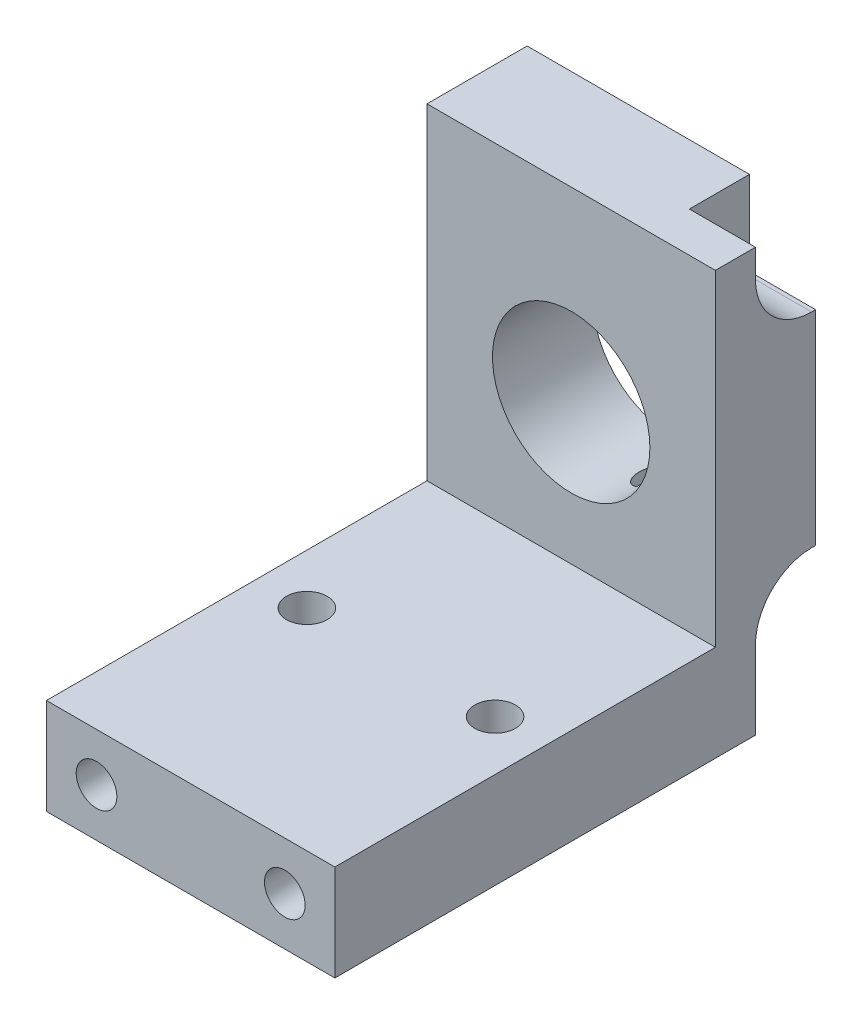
ISO-10303-21;
HEADER;
FILE_DESCRIPTION(('STEP AP214'),'2;1');
FILE_NAME('part.step','',(''),(''),'','','');
FILE_SCHEMA(('AUTOMOTIVE_DESIGN { 1 0 10303 214 1 1 1 1 }'));
ENDSEC;
DATA;
#1=APPLICATION_CONTEXT('core data for automotive mechanical design processes');
#2=APPLICATION_PROTOCOL_DEFINITION('international standard','automotive_design',2000,#1);
#3=PRODUCT_CONTEXT('',#1,'mechanical');
#4=PRODUCT('Part','Part','',(#3));
#5=PRODUCT_RELATED_PRODUCT_CATEGORY('part','',(#4));
#6=PRODUCT_DEFINITION_FORMATION('','',#4);
#7=PRODUCT_DEFINITION_CONTEXT('part definition',#1,'design');
#8=PRODUCT_DEFINITION('design','',#6,#7);
#9=PRODUCT_DEFINITION_SHAPE('','',#8);
#10=(LENGTH_UNIT() NAMED_UNIT(*) SI_UNIT(.MILLI.,.METRE.));
#11=(NAMED_UNIT(*) PLANE_ANGLE_UNIT() SI_UNIT($,.RADIAN.));
#12=(NAMED_UNIT(*) SI_UNIT($,.STERADIAN.) SOLID_ANGLE_UNIT());
#13=UNCERTAINTY_MEASURE_WITH_UNIT(LENGTH_MEASURE(1.E-05),#10,'distance_accuracy_value','');
#14=(GEOMETRIC_REPRESENTATION_CONTEXT(3) GLOBAL_UNCERTAINTY_ASSIGNED_CONTEXT((#13)) GLOBAL_UNIT_ASSIGNED_CONTEXT((#10,
#11,#12)) REPRESENTATION_CONTEXT('',''));
#15=CARTESIAN_POINT('',(0.,0.,0.));
#16=DIRECTION('',(0.,0.,1.));
#17=DIRECTION('',(1.,0.,0.));
#18=AXIS2_PLACEMENT_3D('',#15,#16,#17);
#19=CARTESIAN_POINT('',(34.544,11.811,6.35));
#20=DIRECTION('',(-1.,0.,0.));
#21=DIRECTION('',(0.,-1.,0.));
#22=AXIS2_PLACEMENT_3D('',#19,#20,#21);
#23=PLANE('',#22);
#24=DIRECTION('',(0.,0.,-1.));
#25=VECTOR('',#24,1.);
#26=CARTESIAN_POINT('',(34.544,6.477,6.35));
#27=LINE('',#26,#25);
#28=CARTESIAN_POINT('',(34.544,6.477,0.253999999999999));
#29=VERTEX_POINT('',#28);
#30=CARTESIAN_POINT('',(34.544,6.477,0.));
#31=VERTEX_POINT('',#30);
#32=EDGE_CURVE('E224',#29,#31,#27,.T.);
#33=ORIENTED_EDGE('',*,*,#32,.F.);
#34=CARTESIAN_POINT('',(34.544,10.033,0.253999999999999));
#35=DIRECTION('',(-1.,0.,0.));
#36=DIRECTION('',(0.,-1.,0.));
#37=AXIS2_PLACEMENT_3D('',#34,#35,#36);
#38=CIRCLE('',#37,3.556);
#39=CARTESIAN_POINT('',(34.544,10.033,3.81));
#40=VERTEX_POINT('',#39);
#41=EDGE_CURVE('E144',#29,#40,#38,.T.);
#42=ORIENTED_EDGE('',*,*,#41,.T.);
#43=DIRECTION('',(0.,-1.,0.));
#44=VECTOR('',#43,1.);
#45=CARTESIAN_POINT('',(34.544,11.811,3.81));
#46=LINE('',#45,#44);
#47=CARTESIAN_POINT('',(34.544,11.811,3.81));
#48=VERTEX_POINT('',#47);
#49=EDGE_CURVE('E218',#48,#40,#46,.T.);
#50=ORIENTED_EDGE('',*,*,#49,.F.);
#51=DIRECTION('',(0.,0.,-1.));
#52=VECTOR('',#51,1.);
#53=CARTESIAN_POINT('',(34.544,11.811,6.35));
#54=LINE('',#53,#52);
#55=CARTESIAN_POINT('',(34.544,11.811,6.35));
#56=VERTEX_POINT('',#55);
#57=EDGE_CURVE('E301',#56,#48,#54,.T.);
#58=ORIENTED_EDGE('',*,*,#57,.F.);
#59=DIRECTION('',(0.,1.,0.));
#60=VECTOR('',#59,1.);
#61=CARTESIAN_POINT('',(34.544,11.811,6.35));
#62=LINE('',#61,#60);
#63=CARTESIAN_POINT('',(34.544,-8.88999999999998,6.35));
#64=VERTEX_POINT('',#63);
#65=EDGE_CURVE('E182',#64,#56,#62,.T.);
#66=ORIENTED_EDGE('',*,*,#65,.F.);
#67=DIRECTION('',(0.,0.,-1.));
#68=VECTOR('',#67,1.);
#69=CARTESIAN_POINT('',(34.544,-8.89,30.48));
#70=LINE('',#69,#68);
#71=CARTESIAN_POINT('',(34.544,-8.89,30.48));
#72=VERTEX_POINT('',#71);
#73=EDGE_CURVE('E165',#72,#64,#70,.T.);
#74=ORIENTED_EDGE('',*,*,#73,.F.);
#75=DIRECTION('',(0.,1.,0.));
#76=VECTOR('',#75,1.);
#77=CARTESIAN_POINT('',(34.544,-8.89,30.48));
#78=LINE('',#77,#76);
#79=CARTESIAN_POINT('',(34.544,-14.986,30.48));
#80=VERTEX_POINT('',#79);
#81=EDGE_CURVE('E191',#80,#72,#78,.T.);
#82=ORIENTED_EDGE('',*,*,#81,.F.);
#83=DIRECTION('',(0.,0.,-1.));
#84=VECTOR('',#83,1.);
#85=CARTESIAN_POINT('',(34.544,-14.986,6.35));
#86=LINE('',#85,#84);
#87=CARTESIAN_POINT('',(34.544,-14.986,3.81));
#88=VERTEX_POINT('',#87);
#89=EDGE_CURVE('E299',#80,#88,#86,.T.);
#90=ORIENTED_EDGE('',*,*,#89,.T.);
#91=DIRECTION('',(0.,-1.,0.));
#92=VECTOR('',#91,1.);
#93=CARTESIAN_POINT('',(34.544,11.811,3.81));
#94=LINE('',#93,#92);
#95=CARTESIAN_POINT('',(34.544,-10.033,3.81));
#96=VERTEX_POINT('',#95);
#97=EDGE_CURVE('E422',#96,#88,#94,.T.);
#98=ORIENTED_EDGE('',*,*,#97,.F.);
#99=CARTESIAN_POINT('',(34.544,-10.033,0.253999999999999));
#100=DIRECTION('',(-1.,0.,0.));
#101=DIRECTION('',(0.,-1.,0.));
#102=AXIS2_PLACEMENT_3D('',#99,#100,#101);
#103=CIRCLE('',#102,3.556);
#104=CARTESIAN_POINT('',(34.544,-6.477,0.253999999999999));
#105=VERTEX_POINT('',#104);
#106=EDGE_CURVE('E342',#96,#105,#103,.T.);
#107=ORIENTED_EDGE('',*,*,#106,.T.);
#108=DIRECTION('',(0.,0.,-1.));
#109=VECTOR('',#108,1.);
#110=CARTESIAN_POINT('',(34.544,-6.477,6.35));
#111=LINE('',#110,#109);
#112=CARTESIAN_POINT('',(34.544,-6.477,0.));
#113=VERTEX_POINT('',#112);
#114=EDGE_CURVE('E210',#105,#113,#111,.T.);
#115=ORIENTED_EDGE('',*,*,#114,.T.);
#116=DIRECTION('',(0.,1.,0.));
#117=VECTOR('',#116,1.);
#118=CARTESIAN_POINT('',(34.544,11.811,0.));
#119=LINE('',#118,#117);
#120=EDGE_CURVE('E310',#113,#31,#119,.T.);
#121=ORIENTED_EDGE('',*,*,#120,.T.);
#122=EDGE_LOOP('',(#33,#42,#50,#58,#66,#74,#82,#90,#98,#107,#115,#121));
#123=FACE_BOUND('',#122,.T.);
#124=ADVANCED_FACE('F34',(#123),#23,.F.);
#125=CARTESIAN_POINT('',(16.256,11.811,6.35));
#126=DIRECTION('',(0.,-1.,0.));
#127=DIRECTION('',(0.,0.,-1.));
#128=AXIS2_PLACEMENT_3D('',#125,#126,#127);
#129=PLANE('',#128);
#130=DIRECTION('',(0.,0.,1.));
#131=VECTOR('',#130,1.);
#132=CARTESIAN_POINT('',(30.353,11.811,6.35));
#133=LINE('',#132,#131);
#134=CARTESIAN_POINT('',(30.353,11.811,0.));
#135=VERTEX_POINT('',#134);
#136=CARTESIAN_POINT('',(30.353,11.811,3.81));
#137=VERTEX_POINT('',#136);
#138=EDGE_CURVE('E222',#135,#137,#133,.T.);
#139=ORIENTED_EDGE('',*,*,#138,.F.);
#140=DIRECTION('',(-1.,0.,0.));
#141=VECTOR('',#140,1.);
#142=CARTESIAN_POINT('',(16.256,11.811,0.));
#143=LINE('',#142,#141);
#144=CARTESIAN_POINT('',(16.256,11.811,0.));
#145=VERTEX_POINT('',#144);
#146=EDGE_CURVE('E183',#135,#145,#143,.T.);
#147=ORIENTED_EDGE('',*,*,#146,.T.);
#148=DIRECTION('',(0.,0.,-1.));
#149=VECTOR('',#148,1.);
#150=CARTESIAN_POINT('',(16.256,11.811,6.35));
#151=LINE('',#150,#149);
#152=CARTESIAN_POINT('',(16.256,11.811,6.35));
#153=VERTEX_POINT('',#152);
#154=EDGE_CURVE('E304',#153,#145,#151,.T.);
#155=ORIENTED_EDGE('',*,*,#154,.F.);
#156=DIRECTION('',(-1.,0.,0.));
#157=VECTOR('',#156,1.);
#158=CARTESIAN_POINT('',(16.256,11.811,6.35));
#159=LINE('',#158,#157);
#160=EDGE_CURVE('E187',#56,#153,#159,.T.);
#161=ORIENTED_EDGE('',*,*,#160,.F.);
#162=ORIENTED_EDGE('',*,*,#57,.T.);
#163=DIRECTION('',(1.,0.,0.));
#164=VECTOR('',#163,1.);
#165=CARTESIAN_POINT('',(16.256,11.811,3.81));
#166=LINE('',#165,#164);
#167=EDGE_CURVE('E344',#137,#48,#166,.T.);
#168=ORIENTED_EDGE('',*,*,#167,.F.);
#169=EDGE_LOOP('',(#139,#147,#155,#161,#162,#168));
#170=FACE_BOUND('',#169,.T.);
#171=ADVANCED_FACE('F320',(#170),#129,.F.);
#172=CARTESIAN_POINT('',(16.256,-14.986,0.));
#173=DIRECTION('',(0.,0.,1.));
#174=DIRECTION('',(1.,0.,0.));
#175=AXIS2_PLACEMENT_3D('',#172,#173,#174);
#176=PLANE('',#175);
#177=CARTESIAN_POINT('',(25.4,0.,0.));
#178=DIRECTION('',(0.,0.,1.));
#179=DIRECTION('',(1.,0.,0.));
#180=AXIS2_PLACEMENT_3D('',#177,#178,#179);
#181=CIRCLE('',#180,4.9911);
#182=CARTESIAN_POINT('',(30.3911,0.,0.));
#183=VERTEX_POINT('',#182);
#184=EDGE_CURVE('E160',#183,#183,#181,.T.);
#185=ORIENTED_EDGE('',*,*,#184,.T.);
#186=EDGE_LOOP('',(#185));
#187=FACE_BOUND('',#186,.T.);
#188=DIRECTION('',(0.,1.,0.));
#189=VECTOR('',#188,1.);
#190=CARTESIAN_POINT('',(30.353,-14.986,0.));
#191=LINE('',#190,#189);
#192=CARTESIAN_POINT('',(30.353,6.477,0.));
#193=VERTEX_POINT('',#192);
#194=EDGE_CURVE('E347',#193,#135,#191,.T.);
#195=ORIENTED_EDGE('',*,*,#194,.F.);
#196=DIRECTION('',(1.,0.,0.));
#197=VECTOR('',#196,1.);
#198=CARTESIAN_POINT('',(30.353,6.477,0.));
#199=LINE('',#198,#197);
#200=EDGE_CURVE('E229',#193,#31,#199,.T.);
#201=ORIENTED_EDGE('',*,*,#200,.T.);
#202=ORIENTED_EDGE('',*,*,#120,.F.);
#203=DIRECTION('',(1.,0.,0.));
#204=VECTOR('',#203,1.);
#205=CARTESIAN_POINT('',(30.353,-6.477,0.));
#206=LINE('',#205,#204);
#207=CARTESIAN_POINT('',(30.353,-6.477,0.));
#208=VERTEX_POINT('',#207);
#209=EDGE_CURVE('E215',#208,#113,#206,.T.);
#210=ORIENTED_EDGE('',*,*,#209,.F.);
#211=DIRECTION('',(0.,-1.,0.));
#212=VECTOR('',#211,1.);
#213=CARTESIAN_POINT('',(30.353,-14.986,0.));
#214=LINE('',#213,#212);
#215=CARTESIAN_POINT('',(30.353,-14.986,0.));
#216=VERTEX_POINT('',#215);
#217=EDGE_CURVE('E302',#208,#216,#214,.T.);
#218=ORIENTED_EDGE('',*,*,#217,.T.);
#219=DIRECTION('',(1.,0.,0.));
#220=VECTOR('',#219,1.);
#221=CARTESIAN_POINT('',(16.256,-14.986,0.));
#222=LINE('',#221,#220);
#223=CARTESIAN_POINT('',(16.256,-14.986,0.));
#224=VERTEX_POINT('',#223);
#225=EDGE_CURVE('E313',#224,#216,#222,.T.);
#226=ORIENTED_EDGE('',*,*,#225,.F.);
#227=DIRECTION('',(0.,-1.,0.));
#228=VECTOR('',#227,1.);
#229=CARTESIAN_POINT('',(16.256,11.811,0.));
#230=LINE('',#229,#228);
#231=EDGE_CURVE('E167',#145,#224,#230,.T.);
#232=ORIENTED_EDGE('',*,*,#231,.F.);
#233=ORIENTED_EDGE('',*,*,#146,.F.);
#234=EDGE_LOOP('',(#195,#201,#202,#210,#218,#226,#232,#233));
#235=FACE_BOUND('',#234,.T.);
#236=ADVANCED_FACE('F325',(#187,#235),#176,.F.);
#237=CARTESIAN_POINT('',(16.256,11.811,6.35));
#238=DIRECTION('',(1.,0.,0.));
#239=DIRECTION('',(0.,1.,0.));
#240=AXIS2_PLACEMENT_3D('',#237,#238,#239);
#241=PLANE('',#240);
#242=ORIENTED_EDGE('',*,*,#231,.T.);
#243=DIRECTION('',(0.,0.,-1.));
#244=VECTOR('',#243,1.);
#245=CARTESIAN_POINT('',(16.256,-14.986,6.35));
#246=LINE('',#245,#244);
#247=CARTESIAN_POINT('',(16.256,-14.986,30.48));
#248=VERTEX_POINT('',#247);
#249=EDGE_CURVE('E184',#248,#224,#246,.T.);
#250=ORIENTED_EDGE('',*,*,#249,.F.);
#251=DIRECTION('',(0.,-1.,0.));
#252=VECTOR('',#251,1.);
#253=CARTESIAN_POINT('',(16.256,-8.89,30.48));
#254=LINE('',#253,#252);
#255=CARTESIAN_POINT('',(16.256,-8.89,30.48));
#256=VERTEX_POINT('',#255);
#257=EDGE_CURVE('E199',#256,#248,#254,.T.);
#258=ORIENTED_EDGE('',*,*,#257,.F.);
#259=DIRECTION('',(0.,0.,-1.));
#260=VECTOR('',#259,1.);
#261=CARTESIAN_POINT('',(16.256,-8.89,30.48));
#262=LINE('',#261,#260);
#263=CARTESIAN_POINT('',(16.256,-8.89,6.35));
#264=VERTEX_POINT('',#263);
#265=EDGE_CURVE('E170',#256,#264,#262,.T.);
#266=ORIENTED_EDGE('',*,*,#265,.T.);
#267=DIRECTION('',(0.,-1.,0.));
#268=VECTOR('',#267,1.);
#269=CARTESIAN_POINT('',(16.256,11.811,6.35));
#270=LINE('',#269,#268);
#271=EDGE_CURVE('E179',#153,#264,#270,.T.);
#272=ORIENTED_EDGE('',*,*,#271,.F.);
#273=ORIENTED_EDGE('',*,*,#154,.T.);
#274=EDGE_LOOP('',(#242,#250,#258,#266,#272,#273));
#275=FACE_BOUND('',#274,.T.);
#276=ADVANCED_FACE('F293',(#275),#241,.F.);
#277=CARTESIAN_POINT('',(16.256,-14.986,6.35));
#278=DIRECTION('',(0.,1.,0.));
#279=DIRECTION('',(0.,0.,1.));
#280=AXIS2_PLACEMENT_3D('',#277,#278,#279);
#281=PLANE('',#280);
#282=CARTESIAN_POINT('',(31.369,-14.986,17.145));
#283=DIRECTION('',(0.,-1.,0.));
#284=DIRECTION('',(0.,0.,-1.));
#285=AXIS2_PLACEMENT_3D('',#282,#283,#284);
#286=CIRCLE('',#285,1.28904999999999);
#287=CARTESIAN_POINT('',(31.369,-14.986,15.85595));
#288=VERTEX_POINT('',#287);
#289=EDGE_CURVE('E246',#288,#288,#286,.T.);
#290=ORIENTED_EDGE('',*,*,#289,.F.);
#291=EDGE_LOOP('',(#290));
#292=FACE_BOUND('',#291,.T.);
#293=CARTESIAN_POINT('',(19.431,-14.986,17.145));
#294=DIRECTION('',(0.,-1.,0.));
#295=DIRECTION('',(0.,0.,-1.));
#296=AXIS2_PLACEMENT_3D('',#293,#294,#295);
#297=CIRCLE('',#296,1.28904999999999);
#298=CARTESIAN_POINT('',(19.431,-14.986,15.85595));
#299=VERTEX_POINT('',#298);
#300=EDGE_CURVE('E243',#299,#299,#297,.T.);
#301=ORIENTED_EDGE('',*,*,#300,.F.);
#302=EDGE_LOOP('',(#301));
#303=FACE_BOUND('',#302,.T.);
#304=CARTESIAN_POINT('',(19.431,-14.986,3.175));
#305=DIRECTION('',(0.,-1.,0.));
#306=DIRECTION('',(0.,0.,-1.));
#307=AXIS2_PLACEMENT_3D('',#304,#305,#306);
#308=CIRCLE('',#307,1.28904999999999);
#309=CARTESIAN_POINT('',(19.431,-14.986,1.88595000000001));
#310=VERTEX_POINT('',#309);
#311=EDGE_CURVE('E149',#310,#310,#308,.T.);
#312=ORIENTED_EDGE('',*,*,#311,.F.);
#313=EDGE_LOOP('',(#312));
#314=FACE_BOUND('',#313,.T.);
#315=CARTESIAN_POINT('',(27.813,-14.986,3.175));
#316=DIRECTION('',(0.,-1.,0.));
#317=DIRECTION('',(0.,0.,-1.));
#318=AXIS2_PLACEMENT_3D('',#315,#316,#317);
#319=CIRCLE('',#318,1.28904999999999);
#320=CARTESIAN_POINT('',(27.813,-14.986,1.88595000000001));
#321=VERTEX_POINT('',#320);
#322=EDGE_CURVE('E148',#321,#321,#319,.T.);
#323=ORIENTED_EDGE('',*,*,#322,.F.);
#324=EDGE_LOOP('',(#323));
#325=FACE_BOUND('',#324,.T.);
#326=ORIENTED_EDGE('',*,*,#225,.T.);
#327=DIRECTION('',(0.,0.,1.));
#328=VECTOR('',#327,1.);
#329=CARTESIAN_POINT('',(30.353,-14.986,6.35));
#330=LINE('',#329,#328);
#331=CARTESIAN_POINT('',(30.353,-14.986,3.81));
#332=VERTEX_POINT('',#331);
#333=EDGE_CURVE('E207',#216,#332,#330,.T.);
#334=ORIENTED_EDGE('',*,*,#333,.T.);
#335=DIRECTION('',(-1.,0.,0.));
#336=VECTOR('',#335,1.);
#337=CARTESIAN_POINT('',(16.256,-14.986,3.81));
#338=LINE('',#337,#336);
#339=EDGE_CURVE('E192',#88,#332,#338,.T.);
#340=ORIENTED_EDGE('',*,*,#339,.F.);
#341=ORIENTED_EDGE('',*,*,#89,.F.);
#342=DIRECTION('',(1.,0.,0.));
#343=VECTOR('',#342,1.);
#344=CARTESIAN_POINT('',(34.544,-14.986,30.48));
#345=LINE('',#344,#343);
#346=EDGE_CURVE('E196',#248,#80,#345,.T.);
#347=ORIENTED_EDGE('',*,*,#346,.F.);
#348=ORIENTED_EDGE('',*,*,#249,.T.);
#349=EDGE_LOOP('',(#326,#334,#340,#341,#347,#348));
#350=FACE_BOUND('',#349,.T.);
#351=ADVANCED_FACE('F297',(#292,#303,#314,#325,#350),#281,.F.);
#352=CARTESIAN_POINT('',(16.256,-14.986,6.35));
#353=DIRECTION('',(0.,0.,1.));
#354=DIRECTION('',(1.,0.,0.));
#355=AXIS2_PLACEMENT_3D('',#352,#353,#354);
#356=PLANE('',#355);
#357=DIRECTION('',(-1.,0.,0.));
#358=VECTOR('',#357,1.);
#359=CARTESIAN_POINT('',(34.544,-8.89,6.35));
#360=LINE('',#359,#358);
#361=EDGE_CURVE('E188',#64,#264,#360,.T.);
#362=ORIENTED_EDGE('',*,*,#361,.F.);
#363=ORIENTED_EDGE('',*,*,#65,.T.);
#364=ORIENTED_EDGE('',*,*,#160,.T.);
#365=ORIENTED_EDGE('',*,*,#271,.T.);
#366=EDGE_LOOP('',(#362,#363,#364,#365));
#367=FACE_BOUND('',#366,.T.);
#368=CARTESIAN_POINT('',(25.4,0.,6.35));
#369=DIRECTION('',(0.,0.,1.));
#370=DIRECTION('',(1.,0.,0.));
#371=AXIS2_PLACEMENT_3D('',#368,#369,#370);
#372=CIRCLE('',#371,4.9911);
#373=CARTESIAN_POINT('',(30.3911,0.,6.35));
#374=VERTEX_POINT('',#373);
#375=EDGE_CURVE('E163',#374,#374,#372,.T.);
#376=ORIENTED_EDGE('',*,*,#375,.F.);
#377=EDGE_LOOP('',(#376));
#378=FACE_BOUND('',#377,.T.);
#379=ADVANCED_FACE('F155',(#367,#378),#356,.T.);
#380=CARTESIAN_POINT('',(25.4,0.,0.));
#381=DIRECTION('',(0.,0.,1.));
#382=DIRECTION('',(1.,0.,0.));
#383=AXIS2_PLACEMENT_3D('',#380,#381,#382);
#384=CYLINDRICAL_SURFACE('',#383,4.9911);
#385=CARTESIAN_POINT('',(27.6700339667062,-4.445,4.45609742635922));
#386=CARTESIAN_POINT('',(27.63532252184,-4.46272924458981,4.4522225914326));
#387=CARTESIAN_POINT('',(27.6005384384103,-4.47997755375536,4.44691222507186));
#388=CARTESIAN_POINT('',(27.5310353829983,-4.51345255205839,4.43333329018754));
#389=CARTESIAN_POINT('',(27.4963164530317,-4.52967871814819,4.42506322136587));
#390=CARTESIAN_POINT('',(27.3925253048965,-4.57675383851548,4.39566199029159));
#391=CARTESIAN_POINT('',(27.3239217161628,-4.60594708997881,4.36995064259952));
#392=CARTESIAN_POINT('',(27.1903769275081,-4.65948881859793,4.30614475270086));
#393=CARTESIAN_POINT('',(27.1254487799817,-4.6838207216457,4.26800897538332));
#394=CARTESIAN_POINT('',(27.0022669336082,-4.7273760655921,4.18002435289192));
#395=CARTESIAN_POINT('',(26.944002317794,-4.74660793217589,4.13019508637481));
#396=CARTESIAN_POINT('',(26.8402625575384,-4.77906751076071,4.02386635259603));
#397=CARTESIAN_POINT('',(26.7941886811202,-4.7926135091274,3.96804664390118));
#398=CARTESIAN_POINT('',(26.7117438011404,-4.81583310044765,3.84889348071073));
#399=CARTESIAN_POINT('',(26.6753759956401,-4.82550541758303,3.78555755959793));
#400=CARTESIAN_POINT('',(26.6147880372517,-4.84110726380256,3.65553169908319));
#401=CARTESIAN_POINT('',(26.5902000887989,-4.84715185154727,3.58902650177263));
#402=CARTESIAN_POINT('',(26.5522335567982,-4.85631770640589,3.45270883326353));
#403=CARTESIAN_POINT('',(26.5388528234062,-4.85943953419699,3.38289699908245));
#404=CARTESIAN_POINT('',(26.5237731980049,-4.86294907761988,3.24226394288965));
#405=CARTESIAN_POINT('',(26.5220239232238,-4.86334858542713,3.17144840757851));
#406=CARTESIAN_POINT('',(26.5301295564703,-4.86147128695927,3.03051882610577));
#407=CARTESIAN_POINT('',(26.5399846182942,-4.85919444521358,2.96040478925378));
#408=CARTESIAN_POINT('',(26.5709810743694,-4.85181757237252,2.82284831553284));
#409=CARTESIAN_POINT('',(26.5921259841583,-4.84671666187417,2.75540671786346));
#410=CARTESIAN_POINT('',(26.6449948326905,-4.83340518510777,2.62513164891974));
#411=CARTESIAN_POINT('',(26.6767191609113,-4.82519450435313,2.56229834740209));
#412=CARTESIAN_POINT('',(26.7496375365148,-4.80530742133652,2.44301992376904));
#413=CARTESIAN_POINT('',(26.7908294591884,-4.79363179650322,2.38657337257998));
#414=CARTESIAN_POINT('',(26.8812019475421,-4.76648077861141,2.28158051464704));
#415=CARTESIAN_POINT('',(26.9303797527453,-4.75100669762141,2.23303148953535));
#416=CARTESIAN_POINT('',(27.0353814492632,-4.71589738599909,2.14460773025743));
#417=CARTESIAN_POINT('',(27.0912546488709,-4.69623033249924,2.10480434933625));
#418=CARTESIAN_POINT('',(27.2074231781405,-4.65275733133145,2.03503378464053));
#419=CARTESIAN_POINT('',(27.2677225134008,-4.62894760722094,2.00507564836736));
#420=CARTESIAN_POINT('',(27.3849702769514,-4.57980460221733,1.95760139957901));
#421=CARTESIAN_POINT('',(27.4417065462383,-4.55482065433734,1.9391853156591));
#422=CARTESIAN_POINT('',(27.5557350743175,-4.50198895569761,1.91051192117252));
#423=CARTESIAN_POINT('',(27.6130256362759,-4.47414835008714,1.90023478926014));
#424=CARTESIAN_POINT('',(27.6700339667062,-4.445,1.89390257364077));
#425=B_SPLINE_CURVE_WITH_KNOTS('',3,(#385,#386,#387,#388,#389,#390,#391,#392,#393,#394,#395,
#396,#397,#398,#399,#400,#401,#402,#403,#404,#405,#406,#407,#408,#409,#410,#411,#412,#413,#414,
#415,#416,#417,#418,#419,#420,#421,#422,#423,#424),.UNSPECIFIED.,.F.,.F.,(4,2,2,2,2,2,2,2,2,2,2,
2,2,2,2,2,2,2,2,4),(0.,0.117451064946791,0.234961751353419,0.470327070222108,0.706481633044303,
0.942243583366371,1.16204789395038,1.381924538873,1.59439763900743,1.80682997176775,
2.0183415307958,2.22985589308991,2.44143615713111,2.65302421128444,2.86456482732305,
3.07603247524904,3.28916615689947,3.50249515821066,3.69592327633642,3.88887886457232),.UNSPECIFIED.);
#426=CARTESIAN_POINT('',(27.6700339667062,-4.445,4.45609742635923));
#427=VERTEX_POINT('',#426);
#428=CARTESIAN_POINT('',(27.6700339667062,-4.445,1.89390257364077));
#429=VERTEX_POINT('',#428);
#430=EDGE_CURVE('E43',#427,#429,#425,.T.);
#431=ORIENTED_EDGE('',*,*,#430,.T.);
#432=DIRECTION('',(0.,0.,1.));
#433=VECTOR('',#432,1.);
#434=CARTESIAN_POINT('',(27.6700339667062,-4.445,0.));
#435=LINE('',#434,#433);
#436=EDGE_CURVE('E11',#429,#427,#435,.T.);
#437=ORIENTED_EDGE('',*,*,#436,.T.);
#438=EDGE_LOOP('',(#431,#437));
#439=FACE_BOUND('',#438,.T.);
#440=ORIENTED_EDGE('',*,*,#184,.F.);
#441=EDGE_LOOP('',(#440));
#442=FACE_BOUND('',#441,.T.);
#443=ORIENTED_EDGE('',*,*,#375,.T.);
#444=EDGE_LOOP('',(#443));
#445=FACE_BOUND('',#444,.T.);
#446=ADVANCED_FACE('F151',(#439,#442,#445),#384,.F.);
#447=CARTESIAN_POINT('',(34.544,-8.89,30.48));
#448=DIRECTION('',(0.,-1.,0.));
#449=DIRECTION('',(1.,0.,0.));
#450=AXIS2_PLACEMENT_3D('',#447,#448,#449);
#451=PLANE('',#450);
#452=CARTESIAN_POINT('',(31.369,-8.89,17.145));
#453=DIRECTION('',(0.,-1.,0.));
#454=DIRECTION('',(1.,0.,0.));
#455=AXIS2_PLACEMENT_3D('',#452,#453,#454);
#456=CIRCLE('',#455,1.28905);
#457=CARTESIAN_POINT('',(32.65805,-8.89,17.145));
#458=VERTEX_POINT('',#457);
#459=EDGE_CURVE('E38',#458,#458,#456,.T.);
#460=ORIENTED_EDGE('',*,*,#459,.T.);
#461=EDGE_LOOP('',(#460));
#462=FACE_BOUND('',#461,.T.);
#463=CARTESIAN_POINT('',(19.431,-8.89,17.145));
#464=DIRECTION('',(0.,-1.,0.));
#465=DIRECTION('',(1.,0.,0.));
#466=AXIS2_PLACEMENT_3D('',#463,#464,#465);
#467=CIRCLE('',#466,1.28904999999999);
#468=CARTESIAN_POINT('',(20.72005,-8.89,17.145));
#469=VERTEX_POINT('',#468);
#470=EDGE_CURVE('E240',#469,#469,#467,.T.);
#471=ORIENTED_EDGE('',*,*,#470,.T.);
#472=EDGE_LOOP('',(#471));
#473=FACE_BOUND('',#472,.T.);
#474=ORIENTED_EDGE('',*,*,#361,.T.);
#475=ORIENTED_EDGE('',*,*,#265,.F.);
#476=DIRECTION('',(-1.,0.,0.));
#477=VECTOR('',#476,1.);
#478=CARTESIAN_POINT('',(34.544,-8.89,30.48));
#479=LINE('',#478,#477);
#480=EDGE_CURVE('E202',#72,#256,#479,.T.);
#481=ORIENTED_EDGE('',*,*,#480,.F.);
#482=ORIENTED_EDGE('',*,*,#73,.T.);
#483=EDGE_LOOP('',(#474,#475,#481,#482));
#484=FACE_BOUND('',#483,.T.);
#485=ADVANCED_FACE('F154',(#462,#473,#484),#451,.F.);
#486=CARTESIAN_POINT('',(34.544,-14.986,30.48));
#487=DIRECTION('',(0.,0.,-1.));
#488=DIRECTION('',(-1.,0.,0.));
#489=AXIS2_PLACEMENT_3D('',#486,#487,#488);
#490=PLANE('',#489);
#491=CARTESIAN_POINT('',(19.431,-11.938,30.48));
#492=DIRECTION('',(0.,0.,1.));
#493=DIRECTION('',(1.,0.,0.));
#494=AXIS2_PLACEMENT_3D('',#491,#492,#493);
#495=CIRCLE('',#494,1.28904999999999);
#496=CARTESIAN_POINT('',(20.72005,-11.938,30.48));
#497=VERTEX_POINT('',#496);
#498=EDGE_CURVE('E255',#497,#497,#495,.T.);
#499=ORIENTED_EDGE('',*,*,#498,.F.);
#500=EDGE_LOOP('',(#499));
#501=FACE_BOUND('',#500,.T.);
#502=CARTESIAN_POINT('',(31.369,-11.938,30.48));
#503=DIRECTION('',(0.,0.,1.));
#504=DIRECTION('',(1.,0.,0.));
#505=AXIS2_PLACEMENT_3D('',#502,#503,#504);
#506=CIRCLE('',#505,1.28904999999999);
#507=CARTESIAN_POINT('',(32.65805,-11.938,30.48));
#508=VERTEX_POINT('',#507);
#509=EDGE_CURVE('E249',#508,#508,#506,.T.);
#510=ORIENTED_EDGE('',*,*,#509,.F.);
#511=EDGE_LOOP('',(#510));
#512=FACE_BOUND('',#511,.T.);
#513=ORIENTED_EDGE('',*,*,#81,.T.);
#514=ORIENTED_EDGE('',*,*,#480,.T.);
#515=ORIENTED_EDGE('',*,*,#257,.T.);
#516=ORIENTED_EDGE('',*,*,#346,.T.);
#517=EDGE_LOOP('',(#513,#514,#515,#516));
#518=FACE_BOUND('',#517,.T.);
#519=ADVANCED_FACE('F271',(#501,#512,#518),#490,.F.);
#520=CARTESIAN_POINT('',(30.353,-6.477,3.81));
#521=DIRECTION('',(0.,0.,-1.));
#522=DIRECTION('',(-1.,0.,0.));
#523=AXIS2_PLACEMENT_3D('',#520,#521,#522);
#524=PLANE('',#523);
#525=DIRECTION('',(0.,1.,0.));
#526=VECTOR('',#525,1.);
#527=CARTESIAN_POINT('',(30.353,-15.6095435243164,3.81));
#528=LINE('',#527,#526);
#529=CARTESIAN_POINT('',(30.353,-10.033,3.81));
#530=VERTEX_POINT('',#529);
#531=EDGE_CURVE('E214',#332,#530,#528,.T.);
#532=ORIENTED_EDGE('',*,*,#531,.T.);
#533=DIRECTION('',(1.,0.,0.));
#534=VECTOR('',#533,1.);
#535=CARTESIAN_POINT('',(30.353,-10.033,3.81));
#536=LINE('',#535,#534);
#537=EDGE_CURVE('E338',#530,#96,#536,.T.);
#538=ORIENTED_EDGE('',*,*,#537,.T.);
#539=ORIENTED_EDGE('',*,*,#97,.T.);
#540=ORIENTED_EDGE('',*,*,#339,.T.);
#541=EDGE_LOOP('',(#532,#538,#539,#540));
#542=FACE_BOUND('',#541,.T.);
#543=ADVANCED_FACE('F274',(#542),#524,.T.);
#544=CARTESIAN_POINT('',(30.353,-15.6095435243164,3.81));
#545=DIRECTION('',(-1.,0.,0.));
#546=DIRECTION('',(0.,0.,1.));
#547=AXIS2_PLACEMENT_3D('',#544,#545,#546);
#548=PLANE('',#547);
#549=DIRECTION('',(0.,0.,-1.));
#550=VECTOR('',#549,1.);
#551=CARTESIAN_POINT('',(30.353,-6.477,3.81));
#552=LINE('',#551,#550);
#553=CARTESIAN_POINT('',(30.353,-6.477,0.254));
#554=VERTEX_POINT('',#553);
#555=EDGE_CURVE('E212',#554,#208,#552,.T.);
#556=ORIENTED_EDGE('',*,*,#555,.F.);
#557=CARTESIAN_POINT('',(30.353,-10.033,0.253999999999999));
#558=DIRECTION('',(-1.,0.,0.));
#559=DIRECTION('',(0.,0.,1.));
#560=AXIS2_PLACEMENT_3D('',#557,#558,#559);
#561=CIRCLE('',#560,3.556);
#562=EDGE_CURVE('E334',#554,#530,#561,.F.);
#563=ORIENTED_EDGE('',*,*,#562,.T.);
#564=ORIENTED_EDGE('',*,*,#531,.F.);
#565=ORIENTED_EDGE('',*,*,#333,.F.);
#566=ORIENTED_EDGE('',*,*,#217,.F.);
#567=EDGE_LOOP('',(#556,#563,#564,#565,#566));
#568=FACE_BOUND('',#567,.T.);
#569=ADVANCED_FACE('F332',(#568),#548,.F.);
#570=CARTESIAN_POINT('',(30.353,-6.477,3.81));
#571=DIRECTION('',(0.,1.,0.));
#572=DIRECTION('',(-1.,0.,0.));
#573=AXIS2_PLACEMENT_3D('',#570,#571,#572);
#574=PLANE('',#573);
#575=ORIENTED_EDGE('',*,*,#114,.F.);
#576=DIRECTION('',(1.,0.,0.));
#577=VECTOR('',#576,1.);
#578=CARTESIAN_POINT('',(30.353,-6.477,0.253999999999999));
#579=LINE('',#578,#577);
#580=EDGE_CURVE('E343',#105,#554,#579,.F.);
#581=ORIENTED_EDGE('',*,*,#580,.T.);
#582=ORIENTED_EDGE('',*,*,#555,.T.);
#583=ORIENTED_EDGE('',*,*,#209,.T.);
#584=EDGE_LOOP('',(#575,#581,#582,#583));
#585=FACE_BOUND('',#584,.T.);
#586=ADVANCED_FACE('F377',(#585),#574,.F.);
#587=CARTESIAN_POINT('',(30.353,6.477,3.81));
#588=DIRECTION('',(0.,0.,-1.));
#589=DIRECTION('',(-1.,0.,0.));
#590=AXIS2_PLACEMENT_3D('',#587,#588,#589);
#591=PLANE('',#590);
#592=ORIENTED_EDGE('',*,*,#49,.T.);
#593=DIRECTION('',(1.,0.,0.));
#594=VECTOR('',#593,1.);
#595=CARTESIAN_POINT('',(30.353,10.033,3.81));
#596=LINE('',#595,#594);
#597=CARTESIAN_POINT('',(30.353,10.033,3.81));
#598=VERTEX_POINT('',#597);
#599=EDGE_CURVE('E57',#40,#598,#596,.F.);
#600=ORIENTED_EDGE('',*,*,#599,.T.);
#601=DIRECTION('',(0.,-1.,0.));
#602=VECTOR('',#601,1.);
#603=CARTESIAN_POINT('',(30.353,15.6095435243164,3.81));
#604=LINE('',#603,#602);
#605=EDGE_CURVE('E228',#137,#598,#604,.T.);
#606=ORIENTED_EDGE('',*,*,#605,.F.);
#607=ORIENTED_EDGE('',*,*,#167,.T.);
#608=EDGE_LOOP('',(#592,#600,#606,#607));
#609=FACE_BOUND('',#608,.T.);
#610=ADVANCED_FACE('F373',(#609),#591,.T.);
#611=CARTESIAN_POINT('',(30.353,15.6095435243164,3.81));
#612=DIRECTION('',(1.,0.,0.));
#613=DIRECTION('',(0.,0.,-1.));
#614=AXIS2_PLACEMENT_3D('',#611,#612,#613);
#615=PLANE('',#614);
#616=ORIENTED_EDGE('',*,*,#605,.T.);
#617=CARTESIAN_POINT('',(30.353,10.033,0.253999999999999));
#618=DIRECTION('',(1.,0.,0.));
#619=DIRECTION('',(0.,0.,-1.));
#620=AXIS2_PLACEMENT_3D('',#617,#618,#619);
#621=CIRCLE('',#620,3.556);
#622=CARTESIAN_POINT('',(30.353,6.477,0.254));
#623=VERTEX_POINT('',#622);
#624=EDGE_CURVE('E356',#598,#623,#621,.T.);
#625=ORIENTED_EDGE('',*,*,#624,.T.);
#626=DIRECTION('',(0.,0.,-1.));
#627=VECTOR('',#626,1.);
#628=CARTESIAN_POINT('',(30.353,6.477,3.81));
#629=LINE('',#628,#627);
#630=EDGE_CURVE('E226',#623,#193,#629,.T.);
#631=ORIENTED_EDGE('',*,*,#630,.T.);
#632=ORIENTED_EDGE('',*,*,#194,.T.);
#633=ORIENTED_EDGE('',*,*,#138,.T.);
#634=EDGE_LOOP('',(#616,#625,#631,#632,#633));
#635=FACE_BOUND('',#634,.T.);
#636=ADVANCED_FACE('F376',(#635),#615,.T.);
#637=CARTESIAN_POINT('',(30.353,6.477,3.81));
#638=DIRECTION('',(0.,1.,0.));
#639=DIRECTION('',(-1.,0.,0.));
#640=AXIS2_PLACEMENT_3D('',#637,#638,#639);
#641=PLANE('',#640);
#642=ORIENTED_EDGE('',*,*,#630,.F.);
#643=DIRECTION('',(1.,0.,0.));
#644=VECTOR('',#643,1.);
#645=CARTESIAN_POINT('',(34.544,6.477,0.253999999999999));
#646=LINE('',#645,#644);
#647=EDGE_CURVE('E352',#623,#29,#646,.T.);
#648=ORIENTED_EDGE('',*,*,#647,.T.);
#649=ORIENTED_EDGE('',*,*,#32,.T.);
#650=ORIENTED_EDGE('',*,*,#200,.F.);
#651=EDGE_LOOP('',(#642,#648,#649,#650));
#652=FACE_BOUND('',#651,.T.);
#653=ADVANCED_FACE('F378',(#652),#641,.T.);
#654=CARTESIAN_POINT('',(30.353,-10.033,0.253999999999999));
#655=DIRECTION('',(1.,0.,0.));
#656=DIRECTION('',(0.,1.,0.));
#657=AXIS2_PLACEMENT_3D('',#654,#655,#656);
#658=CYLINDRICAL_SURFACE('',#657,3.556);
#659=ORIENTED_EDGE('',*,*,#562,.F.);
#660=ORIENTED_EDGE('',*,*,#580,.F.);
#661=ORIENTED_EDGE('',*,*,#106,.F.);
#662=ORIENTED_EDGE('',*,*,#537,.F.);
#663=EDGE_LOOP('',(#659,#660,#661,#662));
#664=FACE_BOUND('',#663,.T.);
#665=ADVANCED_FACE('F340',(#664),#658,.F.);
#666=CARTESIAN_POINT('',(30.353,10.033,0.253999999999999));
#667=DIRECTION('',(-1.,0.,0.));
#668=DIRECTION('',(0.,-1.,0.));
#669=AXIS2_PLACEMENT_3D('',#666,#667,#668);
#670=CYLINDRICAL_SURFACE('',#669,3.556);
#671=ORIENTED_EDGE('',*,*,#624,.F.);
#672=ORIENTED_EDGE('',*,*,#599,.F.);
#673=ORIENTED_EDGE('',*,*,#41,.F.);
#674=ORIENTED_EDGE('',*,*,#647,.F.);
#675=EDGE_LOOP('',(#671,#672,#673,#674));
#676=FACE_BOUND('',#675,.T.);
#677=ADVANCED_FACE('F36',(#676),#670,.F.);
#678=CARTESIAN_POINT('',(27.813,-4.445,3.175));
#679=DIRECTION('',(0.,1.,0.));
#680=DIRECTION('',(0.,0.,1.));
#681=AXIS2_PLACEMENT_3D('',#678,#679,#680);
#682=PLANE('',#681);
#683=CARTESIAN_POINT('',(27.813,-4.445,3.175));
#684=DIRECTION('',(0.,-1.,0.));
#685=DIRECTION('',(0.,0.,-1.));
#686=AXIS2_PLACEMENT_3D('',#683,#684,#685);
#687=CIRCLE('',#686,1.28905);
#688=EDGE_CURVE('E49',#429,#427,#687,.T.);
#689=ORIENTED_EDGE('',*,*,#688,.T.);
#690=ORIENTED_EDGE('',*,*,#436,.F.);
#691=EDGE_LOOP('',(#689,#690));
#692=FACE_BOUND('',#691,.T.);
#693=ADVANCED_FACE('F147',(#692),#682,.F.);
#694=CARTESIAN_POINT('',(27.813,-14.986,3.175));
#695=DIRECTION('',(0.,-1.,0.));
#696=DIRECTION('',(0.,0.,-1.));
#697=AXIS2_PLACEMENT_3D('',#694,#695,#696);
#698=CYLINDRICAL_SURFACE('',#697,1.28904999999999);
#699=ORIENTED_EDGE('',*,*,#322,.T.);
#700=EDGE_LOOP('',(#699));
#701=FACE_BOUND('',#700,.T.);
#702=ORIENTED_EDGE('',*,*,#688,.F.);
#703=ORIENTED_EDGE('',*,*,#430,.F.);
#704=EDGE_LOOP('',(#702,#703));
#705=FACE_BOUND('',#704,.T.);
#706=ADVANCED_FACE('F142',(#701,#705),#698,.F.);
#707=CARTESIAN_POINT('',(19.431,-14.986,3.175));
#708=DIRECTION('',(0.,-1.,0.));
#709=DIRECTION('',(0.,0.,-1.));
#710=AXIS2_PLACEMENT_3D('',#707,#708,#709);
#711=CYLINDRICAL_SURFACE('',#710,1.28904999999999);
#712=CARTESIAN_POINT('',(19.431,-4.445,3.175));
#713=DIRECTION('',(0.,-1.,0.));
#714=DIRECTION('',(0.,0.,-1.));
#715=AXIS2_PLACEMENT_3D('',#712,#713,#714);
#716=CIRCLE('',#715,1.28905);
#717=CARTESIAN_POINT('',(19.431,-4.445,1.88595));
#718=VERTEX_POINT('',#717);
#719=EDGE_CURVE('E237',#718,#718,#716,.T.);
#720=ORIENTED_EDGE('',*,*,#719,.F.);
#721=EDGE_LOOP('',(#720));
#722=FACE_BOUND('',#721,.T.);
#723=ORIENTED_EDGE('',*,*,#311,.T.);
#724=EDGE_LOOP('',(#723));
#725=FACE_BOUND('',#724,.T.);
#726=ADVANCED_FACE('F370',(#722,#725),#711,.F.);
#727=CARTESIAN_POINT('',(19.431,-4.445,3.175));
#728=DIRECTION('',(0.,1.,0.));
#729=DIRECTION('',(0.,0.,1.));
#730=AXIS2_PLACEMENT_3D('',#727,#728,#729);
#731=PLANE('',#730);
#732=ORIENTED_EDGE('',*,*,#719,.T.);
#733=EDGE_LOOP('',(#732));
#734=FACE_BOUND('',#733,.T.);
#735=ADVANCED_FACE('F443',(#734),#731,.F.);
#736=CARTESIAN_POINT('',(19.431,-14.986,17.145));
#737=DIRECTION('',(0.,-1.,0.));
#738=DIRECTION('',(0.,0.,-1.));
#739=AXIS2_PLACEMENT_3D('',#736,#737,#738);
#740=CYLINDRICAL_SURFACE('',#739,1.28904999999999);
#741=ORIENTED_EDGE('',*,*,#300,.T.);
#742=EDGE_LOOP('',(#741));
#743=FACE_BOUND('',#742,.T.);
#744=ORIENTED_EDGE('',*,*,#470,.F.);
#745=EDGE_LOOP('',(#744));
#746=FACE_BOUND('',#745,.T.);
#747=ADVANCED_FACE('F450',(#743,#746),#740,.F.);
#748=CARTESIAN_POINT('',(31.369,-14.986,17.145));
#749=DIRECTION('',(0.,-1.,0.));
#750=DIRECTION('',(0.,0.,-1.));
#751=AXIS2_PLACEMENT_3D('',#748,#749,#750);
#752=CYLINDRICAL_SURFACE('',#751,1.28905);
#753=ORIENTED_EDGE('',*,*,#289,.T.);
#754=EDGE_LOOP('',(#753));
#755=FACE_BOUND('',#754,.T.);
#756=ORIENTED_EDGE('',*,*,#459,.F.);
#757=EDGE_LOOP('',(#756));
#758=FACE_BOUND('',#757,.T.);
#759=ADVANCED_FACE('F458',(#755,#758),#752,.F.);
#760=CARTESIAN_POINT('',(31.369,-11.938,30.48));
#761=DIRECTION('',(0.,0.,1.));
#762=DIRECTION('',(1.,0.,0.));
#763=AXIS2_PLACEMENT_3D('',#760,#761,#762);
#764=CYLINDRICAL_SURFACE('',#763,1.28904999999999);
#765=CARTESIAN_POINT('',(31.369,-11.938,20.955));
#766=DIRECTION('',(0.,0.,1.));
#767=DIRECTION('',(1.,0.,0.));
#768=AXIS2_PLACEMENT_3D('',#765,#766,#767);
#769=CIRCLE('',#768,1.28905);
#770=CARTESIAN_POINT('',(32.65805,-11.938,20.955));
#771=VERTEX_POINT('',#770);
#772=EDGE_CURVE('E252',#771,#771,#769,.T.);
#773=ORIENTED_EDGE('',*,*,#772,.F.);
#774=EDGE_LOOP('',(#773));
#775=FACE_BOUND('',#774,.T.);
#776=ORIENTED_EDGE('',*,*,#509,.T.);
#777=EDGE_LOOP('',(#776));
#778=FACE_BOUND('',#777,.T.);
#779=ADVANCED_FACE('F466',(#775,#778),#764,.F.);
#780=CARTESIAN_POINT('',(31.369,-11.938,20.955));
#781=DIRECTION('',(0.,0.,-1.));
#782=DIRECTION('',(-1.,0.,0.));
#783=AXIS2_PLACEMENT_3D('',#780,#781,#782);
#784=PLANE('',#783);
#785=ORIENTED_EDGE('',*,*,#772,.T.);
#786=EDGE_LOOP('',(#785));
#787=FACE_BOUND('',#786,.T.);
#788=ADVANCED_FACE('F267',(#787),#784,.F.);
#789=CARTESIAN_POINT('',(19.431,-11.938,30.48));
#790=DIRECTION('',(0.,0.,1.));
#791=DIRECTION('',(1.,0.,0.));
#792=AXIS2_PLACEMENT_3D('',#789,#790,#791);
#793=CYLINDRICAL_SURFACE('',#792,1.28904999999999);
#794=CARTESIAN_POINT('',(19.431,-11.938,20.955));
#795=DIRECTION('',(0.,0.,1.));
#796=DIRECTION('',(1.,0.,0.));
#797=AXIS2_PLACEMENT_3D('',#794,#795,#796);
#798=CIRCLE('',#797,1.28905);
#799=CARTESIAN_POINT('',(20.72005,-11.938,20.955));
#800=VERTEX_POINT('',#799);
#801=EDGE_CURVE('E258',#800,#800,#798,.T.);
#802=ORIENTED_EDGE('',*,*,#801,.F.);
#803=EDGE_LOOP('',(#802));
#804=FACE_BOUND('',#803,.T.);
#805=ORIENTED_EDGE('',*,*,#498,.T.);
#806=EDGE_LOOP('',(#805));
#807=FACE_BOUND('',#806,.T.);
#808=ADVANCED_FACE('F264',(#804,#807),#793,.F.);
#809=CARTESIAN_POINT('',(19.431,-11.938,20.955));
#810=DIRECTION('',(0.,0.,-1.));
#811=DIRECTION('',(-1.,0.,0.));
#812=AXIS2_PLACEMENT_3D('',#809,#810,#811);
#813=PLANE('',#812);
#814=ORIENTED_EDGE('',*,*,#801,.T.);
#815=EDGE_LOOP('',(#814));
#816=FACE_BOUND('',#815,.T.);
#817=ADVANCED_FACE('F262',(#816),#813,.F.);
#818=CLOSED_SHELL('',(#124,#171,#236,#276,#351,#379,#446,#485,#519,#543,#569,#586,#610,#636,
#653,#665,#677,#693,#706,#726,#735,#747,#759,#779,#788,#808,#817));
#819=MANIFOLD_SOLID_BREP('B2',#818);
#820=ADVANCED_BREP_SHAPE_REPRESENTATION('',(#18,#819),#14);
#821=SHAPE_DEFINITION_REPRESENTATION(#9,#820);
ENDSEC;
END-ISO-10303-21;
